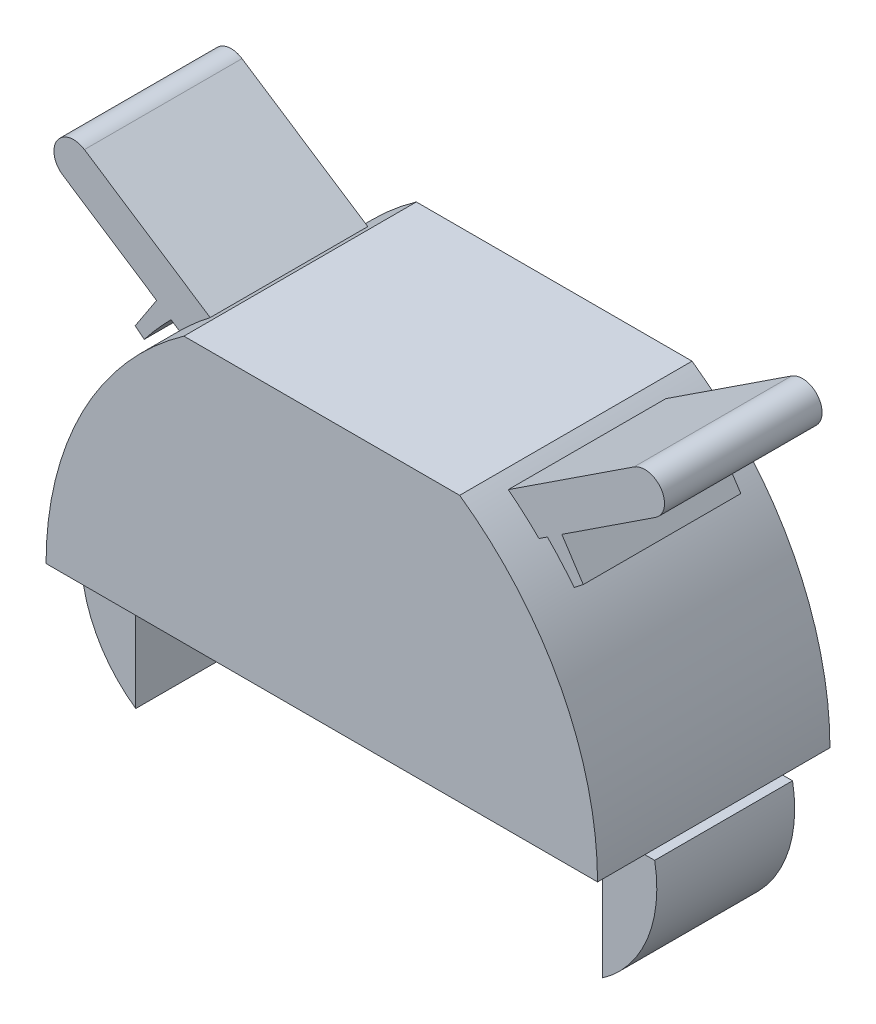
from build123d import *

# Parameters (mm, degrees)
BOSS_EXTRU_1_DEPTH      = 5.9
BOSS_EXTRU_1_DEPTH_BACK = 5.9
BOSS_EXTRU_2_DEPTH      = 3.5
BOSS_EXTRU_2_DEPTH_BACK = 3.5
BOSS_EXTRU_4_DEPTH      = 4


with BuildPart() as part:
    # Esquisse1 → Boss.-Extru.1 (new, two sides: drawn at the far end of the back side and taken through both)
    with BuildSketch(Plane.XY.offset(-BOSS_EXTRU_1_DEPTH_BACK)):
        with BuildLine():
            Line((-14, 0), (14, 0))
            ThreePointArc((14, 0), (12.145945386, 7.603453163), (7, 13.5))
            Line((7, 13.5), (-7, 13.5))
            ThreePointArc((-7, 13.5), (-12.145945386, 7.603453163), (-14, 0))
        make_face()
    extrude(amount=BOSS_EXTRU_1_DEPTH + BOSS_EXTRU_1_DEPTH_BACK)

    # Esquisse2 → Boss.-Extru.2 (add, two sides: drawn at the far end of the back side and taken through both)
    with BuildSketch(Plane.XY.offset(-BOSS_EXTRU_2_DEPTH_BACK)):
        with BuildLine():
            Line((12, 0), (12, -1.3))
            Line((12, -1.3), (11.846024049, -1.3))
            Line((11.846024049, -1.3), (11.846024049, -6.5))
            ThreePointArc((11.846024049, -6.5), (14.128108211, -3.639969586), (14.5, 0))
            Line((14.5, 0), (14, 0))
            Line((14, 0), (12, 0))
        make_face()
        with BuildLine():
            Line((-14, 0), (-12, 0))
            Line((-12, 0), (-12, -1.3))
            Line((-12, -1.3), (-11.846024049, -1.3))
            Line((-11.846024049, -1.3), (-11.846024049, -6.5))
            ThreePointArc((-11.846024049, -6.5), (-14.128108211, -3.639969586), (-14.5, 0))
            Line((-14.5, 0), (-14, 0))
        make_face()
    extrude(amount=BOSS_EXTRU_2_DEPTH + BOSS_EXTRU_2_DEPTH_BACK)

    # Esquisse3 → Boss.-Extru.4 (add, symmetric)
    with BuildSketch(Plane.XY):
        with BuildLine():
            Line((15.04882071, 15.603340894), (10.285976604, 12.476385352))
            Line((10.285976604, 12.476385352), (11.376735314, 10.814988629))
            Line((11.376735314, 10.814988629), (10.911439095, 10.452820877))
            ThreePointArc((10.911439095, 10.452820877), (10.255753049, 11.244658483), (9.553449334, 11.995458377))
            Line((9.553449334, 11.995458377), (9.126596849, 11.715216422))
            ThreePointArc((9.126596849, 11.715216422), (8.367620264, 12.423606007), (7.565640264, 13.082915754))
            Line((7.565640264, 13.082915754), (13.95117929, 17.275221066))
            ThreePointArc((13.95117929, 17.275221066), (15.335940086, 16.98810169), (15.04882071, 15.603340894))
        make_face()
    boss_extru_4 = extrude(amount=BOSS_EXTRU_4_DEPTH, both=True)

    # Sym_trie1: Boss.-Extru.4 across plane
    add(boss_extru_4.mirror(Plane(origin=(0, 0, 0), x_dir=(0, 0, 1), z_dir=(1, 0, 0))))


solid = part.part
